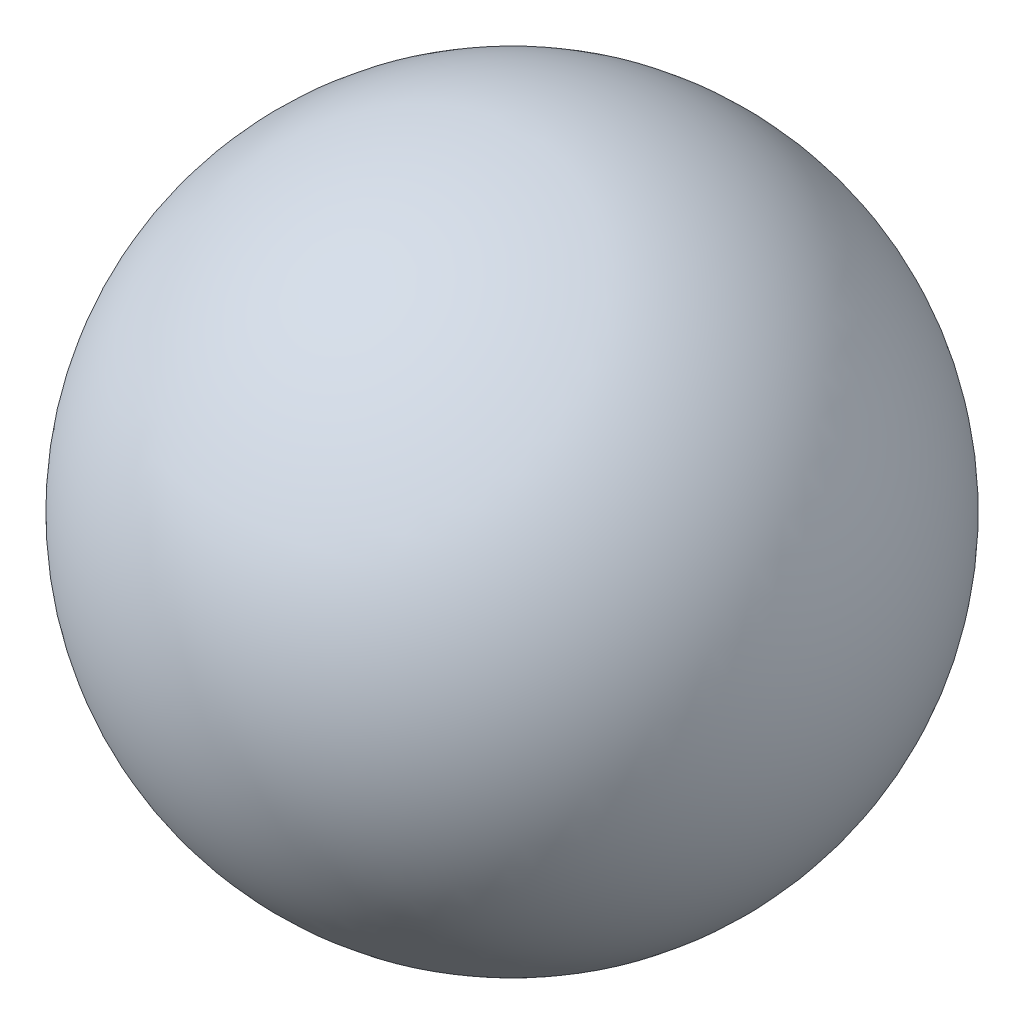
from build123d import *


with BuildPart() as part:
    # Esquisse1 → R_volution1 (revolve)
    with BuildSketch(Plane.XY):
        with BuildLine():
            Line((-8.166666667, 48.75), (-8.166666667, 36.25))
            ThreePointArc((-8.166666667, 36.25), (-14.416666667, 42.5), (-8.166666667, 48.75))
        make_face()
    revolve(axis=Axis((-8.166666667, 48.75, 0), (0, -1, 0)))


solid = part.part
